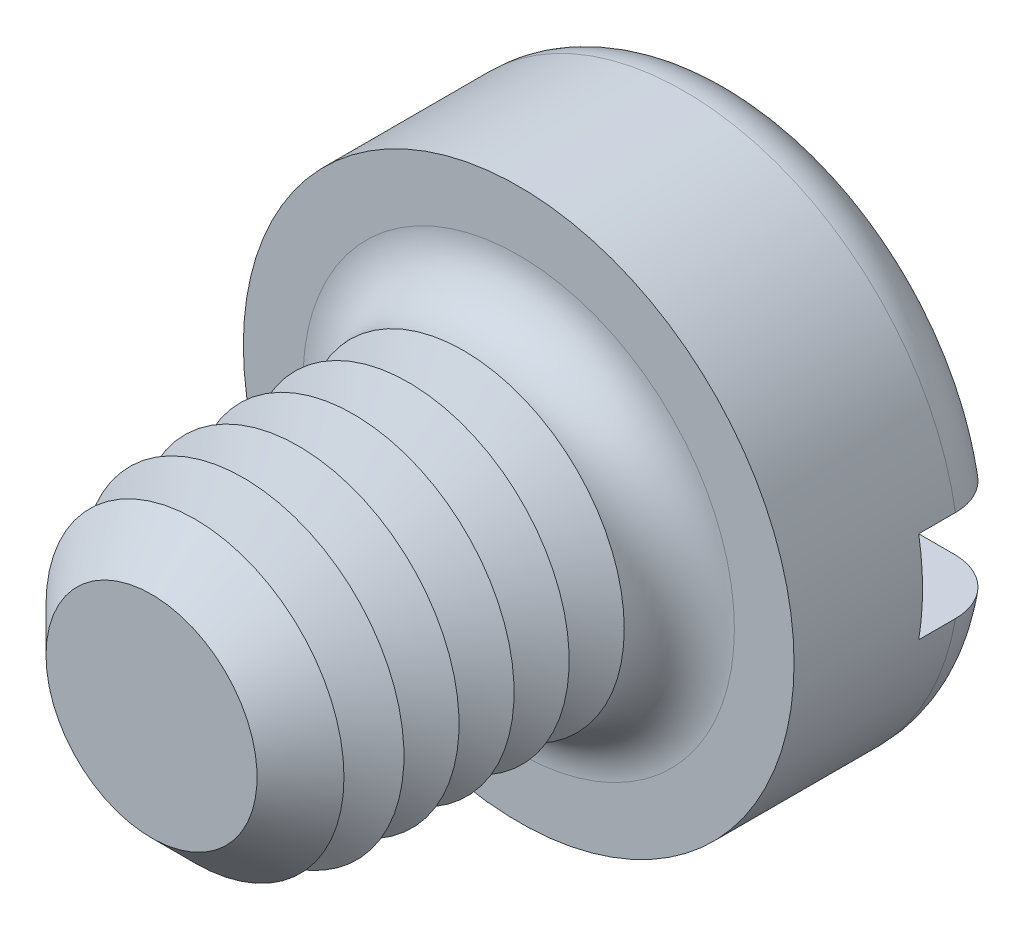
ISO-10303-21;
HEADER;
FILE_DESCRIPTION(('STEP AP214'),'2;1');
FILE_NAME('part.step','',(''),(''),'','','');
FILE_SCHEMA(('AUTOMOTIVE_DESIGN { 1 0 10303 214 1 1 1 1 }'));
ENDSEC;
DATA;
#1=APPLICATION_CONTEXT('core data for automotive mechanical design processes');
#2=APPLICATION_PROTOCOL_DEFINITION('international standard','automotive_design',2000,#1);
#3=PRODUCT_CONTEXT('',#1,'mechanical');
#4=PRODUCT('Part','Part','',(#3));
#5=PRODUCT_RELATED_PRODUCT_CATEGORY('part','',(#4));
#6=PRODUCT_DEFINITION_FORMATION('','',#4);
#7=PRODUCT_DEFINITION_CONTEXT('part definition',#1,'design');
#8=PRODUCT_DEFINITION('design','',#6,#7);
#9=PRODUCT_DEFINITION_SHAPE('','',#8);
#10=(LENGTH_UNIT() NAMED_UNIT(*) SI_UNIT(.MILLI.,.METRE.));
#11=(NAMED_UNIT(*) PLANE_ANGLE_UNIT() SI_UNIT($,.RADIAN.));
#12=(NAMED_UNIT(*) SI_UNIT($,.STERADIAN.) SOLID_ANGLE_UNIT());
#13=UNCERTAINTY_MEASURE_WITH_UNIT(LENGTH_MEASURE(1.E-05),#10,'distance_accuracy_value','');
#14=(GEOMETRIC_REPRESENTATION_CONTEXT(3) GLOBAL_UNCERTAINTY_ASSIGNED_CONTEXT((#13)) GLOBAL_UNIT_ASSIGNED_CONTEXT((#10,
#11,#12)) REPRESENTATION_CONTEXT('',''));
#15=CARTESIAN_POINT('',(0.,0.,0.));
#16=DIRECTION('',(0.,0.,1.));
#17=DIRECTION('',(1.,0.,0.));
#18=AXIS2_PLACEMENT_3D('',#15,#16,#17);
#19=CARTESIAN_POINT('',(0.,0.,-2.4));
#20=DIRECTION('',(0.,0.,1.));
#21=DIRECTION('',(1.,0.,0.));
#22=AXIS2_PLACEMENT_3D('',#19,#20,#21);
#23=PLANE('',#22);
#24=CARTESIAN_POINT('',(0.,0.,-2.4));
#25=DIRECTION('',(0.,0.,1.));
#26=DIRECTION('',(1.,0.,0.));
#27=AXIS2_PLACEMENT_3D('',#24,#25,#26);
#28=CIRCLE('',#27,2.4);
#29=CARTESIAN_POINT('',(-2.3473389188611,0.5,-2.4));
#30=VERTEX_POINT('',#29);
#31=CARTESIAN_POINT('',(2.3473389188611,0.5,-2.4));
#32=VERTEX_POINT('',#31);
#33=EDGE_CURVE('E116',#30,#32,#28,.F.);
#34=ORIENTED_EDGE('',*,*,#33,.T.);
#35=DIRECTION('',(1.,0.,0.));
#36=VECTOR('',#35,1.);
#37=CARTESIAN_POINT('',(-3.,0.5,-2.4));
#38=LINE('',#37,#36);
#39=EDGE_CURVE('E111',#30,#32,#38,.T.);
#40=ORIENTED_EDGE('',*,*,#39,.F.);
#41=EDGE_LOOP('',(#34,#40));
#42=FACE_BOUND('',#41,.T.);
#43=ADVANCED_FACE('F39',(#42),#23,.F.);
#44=CARTESIAN_POINT('',(0.,0.,-1.8));
#45=DIRECTION('',(0.,0.,1.));
#46=DIRECTION('',(1.,0.,0.));
#47=AXIS2_PLACEMENT_3D('',#44,#45,#46);
#48=TOROIDAL_SURFACE('',#47,2.4,0.6);
#49=CARTESIAN_POINT('',(-2.85761641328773,0.5,-2.13010535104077));
#50=CARTESIAN_POINT('',(-2.83871556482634,0.5,-2.1583605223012));
#51=CARTESIAN_POINT('',(-2.81738546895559,0.5,-2.18502342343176));
#52=CARTESIAN_POINT('',(-2.7705148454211,0.5,-2.23439244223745));
#53=CARTESIAN_POINT('',(-2.74496859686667,0.5,-2.25709309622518));
#54=CARTESIAN_POINT('',(-2.6904684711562,0.5,-2.29787524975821));
#55=CARTESIAN_POINT('',(-2.66151863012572,0.5,-2.3159621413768));
#56=CARTESIAN_POINT('',(-2.60103287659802,0.5,-2.34708203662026));
#57=CARTESIAN_POINT('',(-2.56949759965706,0.5,-2.36011627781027));
#58=CARTESIAN_POINT('',(-2.50430694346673,0.5,-2.38095952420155));
#59=CARTESIAN_POINT('',(-2.47062984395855,0.5,-2.38870056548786));
#60=CARTESIAN_POINT('',(-2.40245905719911,0.5,-2.39852415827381));
#61=CARTESIAN_POINT('',(-2.36796525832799,0.5,-2.40060593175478));
#62=CARTESIAN_POINT('',(-2.29850850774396,0.5,-2.39907718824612));
#63=CARTESIAN_POINT('',(-2.2635477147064,0.5,-2.3953679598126));
#64=CARTESIAN_POINT('',(-2.19472542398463,0.5,-2.38219781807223));
#65=CARTESIAN_POINT('',(-2.16086402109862,0.5,-2.37273641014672));
#66=CARTESIAN_POINT('',(-2.09483473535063,0.5,-2.3481926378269));
#67=CARTESIAN_POINT('',(-2.06268841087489,0.5,-2.3330521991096));
#68=CARTESIAN_POINT('',(-2.00140871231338,0.5,-2.29756210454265));
#69=CARTESIAN_POINT('',(-1.97227539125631,0.5,-2.27721235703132));
#70=CARTESIAN_POINT('',(-1.91805676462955,0.5,-2.23196210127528));
#71=CARTESIAN_POINT('',(-1.89294995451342,0.5,-2.20708739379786));
#72=CARTESIAN_POINT('',(-1.84740424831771,0.5,-2.1533758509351));
#73=CARTESIAN_POINT('',(-1.82696468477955,0.5,-2.1245395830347));
#74=CARTESIAN_POINT('',(-1.7919439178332,0.5,-2.06452274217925));
#75=CARTESIAN_POINT('',(-1.7772221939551,0.5,-2.03342424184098));
#76=CARTESIAN_POINT('',(-1.75343025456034,0.5,-1.96913621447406));
#77=CARTESIAN_POINT('',(-1.74435859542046,0.5,-1.93594722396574));
#78=CARTESIAN_POINT('',(-1.73243855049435,0.5,-1.86969199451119));
#79=CARTESIAN_POINT('',(-1.72938008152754,0.5,-1.83666346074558));
#80=CARTESIAN_POINT('',(-1.72896592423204,0.5,-1.77057287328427));
#81=CARTESIAN_POINT('',(-1.73160950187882,0.5,-1.73751082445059));
#82=CARTESIAN_POINT('',(-1.7423966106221,0.5,-1.6729183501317));
#83=CARTESIAN_POINT('',(-1.75043952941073,0.5,-1.64137102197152));
#84=CARTESIAN_POINT('',(-1.77163396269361,0.5,-1.58004446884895));
#85=CARTESIAN_POINT('',(-1.78478577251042,0.5,-1.55026534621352));
#86=CARTESIAN_POINT('',(-1.81598186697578,0.5,-1.49283859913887));
#87=CARTESIAN_POINT('',(-1.83409369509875,0.5,-1.46522772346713));
#88=CARTESIAN_POINT('',(-1.87455179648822,0.5,-1.41330756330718));
#89=CARTESIAN_POINT('',(-1.89689874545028,0.5,-1.38899880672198));
#90=CARTESIAN_POINT('',(-1.94600584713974,0.5,-1.34349499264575));
#91=CARTESIAN_POINT('',(-1.97289034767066,0.5,-1.32243411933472));
#92=CARTESIAN_POINT('',(-2.02972905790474,0.5,-1.28496935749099));
#93=CARTESIAN_POINT('',(-2.05968375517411,0.5,-1.26856621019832));
#94=CARTESIAN_POINT('',(-2.12276894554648,0.5,-1.24040709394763));
#95=CARTESIAN_POINT('',(-2.15596700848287,0.5,-1.22880230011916));
#96=CARTESIAN_POINT('',(-2.22383000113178,0.5,-1.21126311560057));
#97=CARTESIAN_POINT('',(-2.25849504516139,0.5,-1.20532916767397));
#98=CARTESIAN_POINT('',(-2.32870403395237,0.5,-1.1992792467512));
#99=CARTESIAN_POINT('',(-2.36425340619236,0.5,-1.19922586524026));
#100=CARTESIAN_POINT('',(-2.4348506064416,0.5,-1.2051326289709));
#101=CARTESIAN_POINT('',(-2.4698984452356,0.5,-1.21109264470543));
#102=CARTESIAN_POINT('',(-2.53821803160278,0.5,-1.22883658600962));
#103=CARTESIAN_POINT('',(-2.57150081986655,0.5,-1.24057794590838));
#104=CARTESIAN_POINT('',(-2.63557260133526,0.5,-1.2695744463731));
#105=CARTESIAN_POINT('',(-2.66636179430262,0.5,-1.28682914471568));
#106=CARTESIAN_POINT('',(-2.72402406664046,0.5,-1.32606063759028));
#107=CARTESIAN_POINT('',(-2.75095352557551,0.5,-1.34795455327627));
#108=CARTESIAN_POINT('',(-2.80067182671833,0.5,-1.39602603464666));
#109=CARTESIAN_POINT('',(-2.82346106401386,0.5,-1.42220319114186));
#110=CARTESIAN_POINT('',(-2.86383281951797,0.5,-1.47760238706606));
#111=CARTESIAN_POINT('',(-2.88149947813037,0.5,-1.50676312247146));
#112=CARTESIAN_POINT('',(-2.91160874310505,0.5,-1.56766595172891));
#113=CARTESIAN_POINT('',(-2.92405198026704,0.5,-1.59940773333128));
#114=CARTESIAN_POINT('',(-2.94319943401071,0.5,-1.66411282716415));
#115=CARTESIAN_POINT('',(-2.94997843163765,0.5,-1.69705402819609));
#116=CARTESIAN_POINT('',(-2.95787009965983,0.5,-1.7636173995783));
#117=CARTESIAN_POINT('',(-2.95898157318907,0.5,-1.79723971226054));
#118=CARTESIAN_POINT('',(-2.95551354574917,0.5,-1.86397776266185));
#119=CARTESIAN_POINT('',(-2.95096897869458,0.5,-1.89709534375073));
#120=CARTESIAN_POINT('',(-2.93638731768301,0.5,-1.96206785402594));
#121=CARTESIAN_POINT('',(-2.92635713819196,0.5,-1.99392431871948));
#122=CARTESIAN_POINT('',(-2.90618743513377,0.5,-2.04315073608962));
#123=CARTESIAN_POINT('',(-2.89769874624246,0.5,-2.06121519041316));
#124=CARTESIAN_POINT('',(-2.87895753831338,0.5,-2.096404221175));
#125=CARTESIAN_POINT('',(-2.86870503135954,0.5,-2.11352880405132));
#126=CARTESIAN_POINT('',(-2.85761641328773,0.5,-2.13010535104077));
#127=B_SPLINE_CURVE_WITH_KNOTS('',3,(#49,#50,#51,#52,#53,#54,#55,#56,#57,#58,#59,#60,#61,#62,
#63,#64,#65,#66,#67,#68,#69,#70,#71,#72,#73,#74,#75,#76,#77,#78,#79,#80,#81,#82,#83,#84,#85,#86,
#87,#88,#89,#90,#91,#92,#93,#94,#95,#96,#97,#98,#99,#100,#101,#102,#103,#104,#105,#106,#107,
#108,#109,#110,#111,#112,#113,#114,#115,#116,#117,#118,#119,#120,#121,#122,#123,#124,#125,#126),
.UNSPECIFIED.,.T.,.F.,(4,2,2,2,2,2,2,2,2,2,2,2,2,2,2,2,2,2,2,2,2,2,2,2,2,2,2,2,2,2,2,2,2,2,2,2,
2,2,4),(0.,0.101907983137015,0.203955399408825,0.305883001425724,0.40778562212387,
0.51097325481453,0.61417507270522,0.719155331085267,0.824144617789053,0.930238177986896,
1.03633360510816,1.14184204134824,1.24733537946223,1.35004136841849,1.45272110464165,
1.5517448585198,1.65075586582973,1.74797128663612,1.84519232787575,1.9438094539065,
2.0424423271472,2.14443321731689,2.24644032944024,2.35145317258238,2.45647421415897,
2.56261297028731,2.66874944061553,2.77411589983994,2.87947390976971,2.98308820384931,
3.08669260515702,3.18848388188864,3.29026286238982,3.39067588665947,3.49111011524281,
3.59092708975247,3.69061853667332,3.75040561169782,3.81019227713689),.UNSPECIFIED.);
#128=CARTESIAN_POINT('',(-2.95803989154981,0.5,-1.8));
#129=VERTEX_POINT('',#128);
#130=EDGE_CURVE('E225',#129,#30,#127,.T.);
#131=ORIENTED_EDGE('',*,*,#130,.F.);
#132=CARTESIAN_POINT('',(0.,0.,-1.8));
#133=DIRECTION('',(0.,0.,1.));
#134=DIRECTION('',(1.,0.,0.));
#135=AXIS2_PLACEMENT_3D('',#132,#133,#134);
#136=CIRCLE('',#135,3.);
#137=CARTESIAN_POINT('',(2.95803989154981,0.5,-1.8));
#138=VERTEX_POINT('',#137);
#139=EDGE_CURVE('E125',#138,#129,#136,.T.);
#140=ORIENTED_EDGE('',*,*,#139,.F.);
#141=CARTESIAN_POINT('',(1.78664846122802,0.5,-2.05158390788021));
#142=CARTESIAN_POINT('',(1.80142751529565,0.5,-2.08239430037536));
#143=CARTESIAN_POINT('',(1.81889355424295,0.5,-2.11194905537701));
#144=CARTESIAN_POINT('',(1.8585933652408,0.5,-2.16770384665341));
#145=CARTESIAN_POINT('',(1.88083491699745,0.5,-2.19389829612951));
#146=CARTESIAN_POINT('',(1.92931942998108,0.5,-2.24217519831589));
#147=CARTESIAN_POINT('',(1.95555471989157,0.5,-2.26426535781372));
#148=CARTESIAN_POINT('',(2.01127789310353,0.5,-2.30384045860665));
#149=CARTESIAN_POINT('',(2.04076488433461,0.5,-2.32132665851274));
#150=CARTESIAN_POINT('',(2.10290022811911,0.5,-2.3516259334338));
#151=CARTESIAN_POINT('',(2.13560600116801,0.5,-2.3643213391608));
#152=CARTESIAN_POINT('',(2.20267136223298,0.5,-2.38412242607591));
#153=CARTESIAN_POINT('',(2.23703118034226,0.5,-2.3912273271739));
#154=CARTESIAN_POINT('',(2.30690186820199,0.5,-2.39969404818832));
#155=CARTESIAN_POINT('',(2.34242185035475,0.5,-2.40098100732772));
#156=CARTESIAN_POINT('',(2.41317063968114,0.5,-2.39753827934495));
#157=CARTESIAN_POINT('',(2.44839945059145,0.5,-2.39280866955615));
#158=CARTESIAN_POINT('',(2.51734146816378,0.5,-2.37746773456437));
#159=CARTESIAN_POINT('',(2.55106223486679,0.5,-2.3668904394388));
#160=CARTESIAN_POINT('',(2.61620389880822,0.5,-2.34013333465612));
#161=CARTESIAN_POINT('',(2.64762498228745,0.5,-2.32395397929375));
#162=CARTESIAN_POINT('',(2.70673284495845,0.5,-2.28672393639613));
#163=CARTESIAN_POINT('',(2.73447138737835,0.5,-2.26575544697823));
#164=CARTESIAN_POINT('',(2.78595339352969,0.5,-2.21938197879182));
#165=CARTESIAN_POINT('',(2.80969724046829,0.5,-2.19397742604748));
#166=CARTESIAN_POINT('',(2.85207235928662,0.5,-2.13993965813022));
#167=CARTESIAN_POINT('',(2.87078674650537,0.5,-2.11137160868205));
#168=CARTESIAN_POINT('',(2.90307455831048,0.5,-2.05146448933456));
#169=CARTESIAN_POINT('',(2.91664841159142,0.5,-2.02012565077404));
#170=CARTESIAN_POINT('',(2.93808283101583,0.5,-1.95603682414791));
#171=CARTESIAN_POINT('',(2.94602016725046,0.5,-1.92331249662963));
#172=CARTESIAN_POINT('',(2.95624273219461,0.5,-1.85699296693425));
#173=CARTESIAN_POINT('',(2.95852824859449,0.5,-1.82339780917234));
#174=CARTESIAN_POINT('',(2.95738171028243,0.5,-1.75655451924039));
#175=CARTESIAN_POINT('',(2.95399174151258,0.5,-1.72330565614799));
#176=CARTESIAN_POINT('',(2.94167749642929,0.5,-1.65784996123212));
#177=CARTESIAN_POINT('',(2.93275329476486,0.5,-1.62564311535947));
#178=CARTESIAN_POINT('',(2.90963870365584,0.5,-1.56317641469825));
#179=CARTESIAN_POINT('',(2.89544787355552,0.5,-1.53291672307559));
#180=CARTESIAN_POINT('',(2.86222325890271,0.5,-1.47518589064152));
#181=CARTESIAN_POINT('',(2.84318935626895,0.5,-1.44771481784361));
#182=CARTESIAN_POINT('',(2.80067851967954,0.5,-1.39611362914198));
#183=CARTESIAN_POINT('',(2.77716960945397,0.5,-1.37200986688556));
#184=CARTESIAN_POINT('',(2.72648704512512,0.5,-1.3280274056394));
#185=CARTESIAN_POINT('',(2.69931317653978,0.5,-1.3081489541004));
#186=CARTESIAN_POINT('',(2.64167967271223,0.5,-1.27288334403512));
#187=CARTESIAN_POINT('',(2.61118015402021,0.5,-1.25756138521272));
#188=CARTESIAN_POINT('',(2.54807315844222,0.5,-1.2321564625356));
#189=CARTESIAN_POINT('',(2.51546550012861,0.5,-1.22207395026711));
#190=CARTESIAN_POINT('',(2.44846246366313,0.5,-1.20724783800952));
#191=CARTESIAN_POINT('',(2.41404584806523,0.5,-1.2026002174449));
#192=CARTESIAN_POINT('',(2.34491756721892,0.5,-1.19904907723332));
#193=CARTESIAN_POINT('',(2.3102058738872,0.5,-1.20014611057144));
#194=CARTESIAN_POINT('',(2.24087507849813,0.5,-1.20808958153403));
#195=CARTESIAN_POINT('',(2.20626660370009,0.5,-1.21502895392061));
#196=CARTESIAN_POINT('',(2.13868705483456,0.5,-1.23457616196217));
#197=CARTESIAN_POINT('',(2.10571611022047,0.5,-1.24718444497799));
#198=CARTESIAN_POINT('',(2.04212010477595,0.5,-1.2778419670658));
#199=CARTESIAN_POINT('',(2.0115131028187,0.5,-1.29592871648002));
#200=CARTESIAN_POINT('',(1.95381117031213,0.5,-1.33703838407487));
#201=CARTESIAN_POINT('',(1.92671618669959,0.5,-1.36006122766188));
#202=CARTESIAN_POINT('',(1.8771749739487,0.5,-1.41014760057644));
#203=CARTESIAN_POINT('',(1.85467966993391,0.5,-1.43716252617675));
#204=CARTESIAN_POINT('',(1.8147167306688,0.5,-1.49468601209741));
#205=CARTESIAN_POINT('',(1.79724791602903,0.5,-1.52519375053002));
#206=CARTESIAN_POINT('',(1.76843420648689,0.5,-1.58782676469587));
#207=CARTESIAN_POINT('',(1.75691546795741,0.5,-1.61987202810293));
#208=CARTESIAN_POINT('',(1.73963101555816,0.5,-1.68548715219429));
#209=CARTESIAN_POINT('',(1.73386545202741,0.5,-1.71905705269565));
#210=CARTESIAN_POINT('',(1.72840927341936,0.5,-1.78556262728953));
#211=CARTESIAN_POINT('',(1.72852416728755,0.5,-1.81848259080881));
#212=CARTESIAN_POINT('',(1.73434422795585,0.5,-1.88379362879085));
#213=CARTESIAN_POINT('',(1.74004181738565,0.5,-1.91618535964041));
#214=CARTESIAN_POINT('',(1.75312909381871,0.5,-1.96568884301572));
#215=CARTESIAN_POINT('',(1.75869685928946,0.5,-1.98330302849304));
#216=CARTESIAN_POINT('',(1.77146455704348,0.5,-2.01792824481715));
#217=CARTESIAN_POINT('',(1.7786644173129,0.5,-2.03493930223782));
#218=CARTESIAN_POINT('',(1.78664846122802,0.5,-2.05158390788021));
#219=B_SPLINE_CURVE_WITH_KNOTS('',3,(#141,#142,#143,#144,#145,#146,#147,#148,#149,#150,#151,
#152,#153,#154,#155,#156,#157,#158,#159,#160,#161,#162,#163,#164,#165,#166,#167,#168,#169,#170,
#171,#172,#173,#174,#175,#176,#177,#178,#179,#180,#181,#182,#183,#184,#185,#186,#187,#188,#189,
#190,#191,#192,#193,#194,#195,#196,#197,#198,#199,#200,#201,#202,#203,#204,#205,#206,#207,#208,
#209,#210,#211,#212,#213,#214,#215,#216,#217,#218),.UNSPECIFIED.,.T.,.F.,(4,2,2,2,2,2,2,2,2,2,2,
2,2,2,2,2,2,2,2,2,2,2,2,2,2,2,2,2,2,2,2,2,2,2,2,2,2,2,4),(0.,0.102444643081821,
0.205057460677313,0.307475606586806,0.409865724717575,0.514628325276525,0.619405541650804,
0.725527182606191,0.831647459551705,0.937156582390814,1.04265715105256,1.14646746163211,
1.25026780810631,1.3522293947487,1.45418247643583,1.55471883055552,1.6552500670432,
1.75503912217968,1.8548268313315,1.95462289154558,2.05442138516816,2.15496174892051,
2.25550799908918,2.35743049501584,2.45936177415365,2.56306719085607,2.66678259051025,
2.77217967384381,2.87758507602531,2.98372914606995,3.08987161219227,3.19481457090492,
3.29973288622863,3.40138228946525,3.50303434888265,3.6013265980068,3.69948562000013,
3.75483142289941,3.8101747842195),.UNSPECIFIED.);
#220=EDGE_CURVE('E227',#32,#138,#219,.T.);
#221=ORIENTED_EDGE('',*,*,#220,.F.);
#222=ORIENTED_EDGE('',*,*,#33,.F.);
#223=EDGE_LOOP('',(#131,#140,#221,#222));
#224=FACE_BOUND('',#223,.T.);
#225=ADVANCED_FACE('F209',(#224),#48,.T.);
#226=CARTESIAN_POINT('',(0.,0.,-2.4));
#227=DIRECTION('',(0.,0.,1.));
#228=DIRECTION('',(1.,0.,0.));
#229=AXIS2_PLACEMENT_3D('',#226,#227,#228);
#230=CYLINDRICAL_SURFACE('',#229,3.);
#231=DIRECTION('',(0.,0.,1.));
#232=VECTOR('',#231,1.);
#233=CARTESIAN_POINT('',(2.95803989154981,0.5,-2.4));
#234=LINE('',#233,#232);
#235=CARTESIAN_POINT('',(2.95803989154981,0.5,-1.4));
#236=VERTEX_POINT('',#235);
#237=EDGE_CURVE('E242',#138,#236,#234,.T.);
#238=ORIENTED_EDGE('',*,*,#237,.F.);
#239=ORIENTED_EDGE('',*,*,#139,.T.);
#240=DIRECTION('',(0.,0.,1.));
#241=VECTOR('',#240,1.);
#242=CARTESIAN_POINT('',(-2.95803989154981,0.5,-2.4));
#243=LINE('',#242,#241);
#244=CARTESIAN_POINT('',(-2.95803989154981,0.5,-1.4));
#245=VERTEX_POINT('',#244);
#246=EDGE_CURVE('E63',#245,#129,#243,.F.);
#247=ORIENTED_EDGE('',*,*,#246,.F.);
#248=CARTESIAN_POINT('',(0.,0.,-1.4));
#249=DIRECTION('',(0.,0.,-1.));
#250=DIRECTION('',(-1.,0.,0.));
#251=AXIS2_PLACEMENT_3D('',#248,#249,#250);
#252=CIRCLE('',#251,3.);
#253=CARTESIAN_POINT('',(-2.95803989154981,-0.5,-1.4));
#254=VERTEX_POINT('',#253);
#255=EDGE_CURVE('E43',#245,#254,#252,.F.);
#256=ORIENTED_EDGE('',*,*,#255,.T.);
#257=DIRECTION('',(0.,0.,1.));
#258=VECTOR('',#257,1.);
#259=CARTESIAN_POINT('',(-2.95803989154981,-0.5,-2.4));
#260=LINE('',#259,#258);
#261=CARTESIAN_POINT('',(-2.9580398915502,-0.5,-1.79999999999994));
#262=VERTEX_POINT('',#261);
#263=EDGE_CURVE('E239',#262,#254,#260,.T.);
#264=ORIENTED_EDGE('',*,*,#263,.F.);
#265=CARTESIAN_POINT('',(2.95803989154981,-0.5,-1.8));
#266=VERTEX_POINT('',#265);
#267=EDGE_CURVE('E127',#262,#266,#136,.T.);
#268=ORIENTED_EDGE('',*,*,#267,.T.);
#269=DIRECTION('',(0.,0.,1.));
#270=VECTOR('',#269,1.);
#271=CARTESIAN_POINT('',(2.95803989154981,-0.5,-2.4));
#272=LINE('',#271,#270);
#273=CARTESIAN_POINT('',(2.95803989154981,-0.5,-1.4));
#274=VERTEX_POINT('',#273);
#275=EDGE_CURVE('E55',#274,#266,#272,.F.);
#276=ORIENTED_EDGE('',*,*,#275,.F.);
#277=EDGE_CURVE('E11',#274,#236,#252,.F.);
#278=ORIENTED_EDGE('',*,*,#277,.T.);
#279=EDGE_LOOP('',(#238,#239,#247,#256,#264,#268,#276,#278));
#280=FACE_BOUND('',#279,.T.);
#281=CARTESIAN_POINT('',(0.,0.,0.));
#282=DIRECTION('',(0.,0.,1.));
#283=DIRECTION('',(1.,0.,0.));
#284=AXIS2_PLACEMENT_3D('',#281,#282,#283);
#285=CIRCLE('',#284,3.);
#286=CARTESIAN_POINT('',(3.,0.,0.));
#287=VERTEX_POINT('',#286);
#288=EDGE_CURVE('E245',#287,#287,#285,.T.);
#289=ORIENTED_EDGE('',*,*,#288,.F.);
#290=EDGE_LOOP('',(#289));
#291=FACE_BOUND('',#290,.T.);
#292=ADVANCED_FACE('F205',(#280,#291),#230,.T.);
#293=CARTESIAN_POINT('',(2.3473389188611,-0.5,-2.4));
#294=VERTEX_POINT('',#293);
#295=CARTESIAN_POINT('',(-2.3473389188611,-0.5,-2.4));
#296=VERTEX_POINT('',#295);
#297=EDGE_CURVE('E109',#294,#296,#28,.F.);
#298=ORIENTED_EDGE('',*,*,#297,.T.);
#299=DIRECTION('',(-1.,0.,0.));
#300=VECTOR('',#299,1.);
#301=CARTESIAN_POINT('',(-3.,-0.5,-2.4));
#302=LINE('',#301,#300);
#303=EDGE_CURVE('E96',#294,#296,#302,.T.);
#304=ORIENTED_EDGE('',*,*,#303,.F.);
#305=EDGE_LOOP('',(#298,#304));
#306=FACE_BOUND('',#305,.T.);
#307=ADVANCED_FACE('F108',(#306),#23,.F.);
#308=CARTESIAN_POINT('',(0.,0.,0.));
#309=DIRECTION('',(0.,0.,1.));
#310=DIRECTION('',(1.,0.,0.));
#311=AXIS2_PLACEMENT_3D('',#308,#309,#310);
#312=PLANE('',#311);
#313=CARTESIAN_POINT('',(0.,0.,0.));
#314=DIRECTION('',(0.,0.,1.));
#315=DIRECTION('',(1.,0.,0.));
#316=AXIS2_PLACEMENT_3D('',#313,#314,#315);
#317=CIRCLE('',#316,2.35);
#318=CARTESIAN_POINT('',(2.35,0.,0.));
#319=VERTEX_POINT('',#318);
#320=EDGE_CURVE('E115',#319,#319,#317,.F.);
#321=ORIENTED_EDGE('',*,*,#320,.T.);
#322=EDGE_LOOP('',(#321));
#323=FACE_BOUND('',#322,.T.);
#324=ORIENTED_EDGE('',*,*,#288,.T.);
#325=EDGE_LOOP('',(#324));
#326=FACE_BOUND('',#325,.T.);
#327=ADVANCED_FACE('F204',(#323,#326),#312,.T.);
#328=CARTESIAN_POINT('',(-2.85761641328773,-0.5,-2.13010535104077));
#329=CARTESIAN_POINT('',(-2.87617085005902,-0.5,-2.10236255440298));
#330=CARTESIAN_POINT('',(-2.89241094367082,-0.5,-2.07304478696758));
#331=CARTESIAN_POINT('',(-2.91975805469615,-0.5,-2.01207835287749));
#332=CARTESIAN_POINT('',(-2.93085958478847,-0.5,-1.98042723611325));
#333=CARTESIAN_POINT('',(-2.94757590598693,-0.5,-1.91570997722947));
#334=CARTESIAN_POINT('',(-2.95319165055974,-0.5,-1.88264408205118));
#335=CARTESIAN_POINT('',(-2.95876526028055,-0.5,-1.81604673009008));
#336=CARTESIAN_POINT('',(-2.95872441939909,-0.5,-1.78251538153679));
#337=CARTESIAN_POINT('',(-2.95300126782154,-0.5,-1.71606888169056));
#338=CARTESIAN_POINT('',(-2.94734076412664,-0.5,-1.68315184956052));
#339=CARTESIAN_POINT('',(-2.93058183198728,-0.5,-1.61873244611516));
#340=CARTESIAN_POINT('',(-2.91948325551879,-0.5,-1.58723011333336));
#341=CARTESIAN_POINT('',(-2.89215903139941,-0.5,-1.52647404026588));
#342=CARTESIAN_POINT('',(-2.87592518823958,-0.5,-1.49722398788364));
#343=CARTESIAN_POINT('',(-2.83881787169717,-0.5,-1.44183365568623));
#344=CARTESIAN_POINT('',(-2.8179442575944,-0.5,-1.41569347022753));
#345=CARTESIAN_POINT('',(-2.77196258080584,-0.5,-1.36700890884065));
#346=CARTESIAN_POINT('',(-2.74681874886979,-0.5,-1.34449832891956));
#347=CARTESIAN_POINT('',(-2.69315595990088,-0.5,-1.30394571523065));
#348=CARTESIAN_POINT('',(-2.66463678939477,-0.5,-1.28590396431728));
#349=CARTESIAN_POINT('',(-2.6045885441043,-0.5,-1.25451133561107));
#350=CARTESIAN_POINT('',(-2.573021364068,-0.5,-1.24123336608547));
#351=CARTESIAN_POINT('',(-2.50813094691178,-0.5,-1.22006271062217));
#352=CARTESIAN_POINT('',(-2.47480755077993,-0.5,-1.21217051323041));
#353=CARTESIAN_POINT('',(-2.40672281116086,-0.5,-1.20185046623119));
#354=CARTESIAN_POINT('',(-2.37194646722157,-0.5,-1.19952155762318));
#355=CARTESIAN_POINT('',(-2.30248663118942,-0.5,-1.20064178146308));
#356=CARTESIAN_POINT('',(-2.26780314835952,-0.5,-1.20409147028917));
#357=CARTESIAN_POINT('',(-2.19896003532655,-0.5,-1.21674803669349));
#358=CARTESIAN_POINT('',(-2.16481620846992,-0.5,-1.22604100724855));
#359=CARTESIAN_POINT('',(-2.09855902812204,-0.5,-1.25020237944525));
#360=CARTESIAN_POINT('',(-2.0664458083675,-0.5,-1.2650711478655));
#361=CARTESIAN_POINT('',(-2.00504979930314,-0.5,-1.3000633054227));
#362=CARTESIAN_POINT('',(-1.97577870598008,-0.5,-1.32020724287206));
#363=CARTESIAN_POINT('',(-1.92109882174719,-0.5,-1.36519538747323));
#364=CARTESIAN_POINT('',(-1.89568984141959,-0.5,-1.39003936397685));
#365=CARTESIAN_POINT('',(-1.84992350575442,-0.5,-1.44333696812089));
#366=CARTESIAN_POINT('',(-1.82949305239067,-0.5,-1.47172774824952));
#367=CARTESIAN_POINT('',(-1.79388305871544,-0.5,-1.53163225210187));
#368=CARTESIAN_POINT('',(-1.77870235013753,-0.5,-1.56314527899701));
#369=CARTESIAN_POINT('',(-1.7545759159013,-0.5,-1.62726698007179));
#370=CARTESIAN_POINT('',(-1.74543784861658,-0.5,-1.65980327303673));
#371=CARTESIAN_POINT('',(-1.73294830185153,-0.5,-1.72596654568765));
#372=CARTESIAN_POINT('',(-1.72959555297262,-0.5,-1.7595932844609));
#373=CARTESIAN_POINT('',(-1.72881879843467,-0.5,-1.82588200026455));
#374=CARTESIAN_POINT('',(-1.73121660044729,-0.5,-1.85854202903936));
#375=CARTESIAN_POINT('',(-1.74148022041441,-0.5,-1.9229888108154));
#376=CARTESIAN_POINT('',(-1.74934586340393,-0.5,-1.95477559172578));
#377=CARTESIAN_POINT('',(-1.77023164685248,-0.5,-2.01650910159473));
#378=CARTESIAN_POINT('',(-1.78323812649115,-0.5,-2.04646046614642));
#379=CARTESIAN_POINT('',(-1.81396733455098,-0.5,-2.10383471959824));
#380=CARTESIAN_POINT('',(-1.83169061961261,-0.5,-2.13125730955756));
#381=CARTESIAN_POINT('',(-1.87183626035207,-0.5,-2.18359240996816));
#382=CARTESIAN_POINT('',(-1.89437158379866,-0.5,-2.20841820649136));
#383=CARTESIAN_POINT('',(-1.94316463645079,-0.5,-2.25409214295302));
#384=CARTESIAN_POINT('',(-1.96942301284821,-0.5,-2.27493958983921));
#385=CARTESIAN_POINT('',(-2.025898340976,-0.5,-2.31281042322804));
#386=CARTESIAN_POINT('',(-2.0562208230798,-0.5,-2.32967654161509));
#387=CARTESIAN_POINT('',(-2.11922391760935,-0.5,-2.35820255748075));
#388=CARTESIAN_POINT('',(-2.15190483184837,-0.5,-2.3698617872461));
#389=CARTESIAN_POINT('',(-2.21944675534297,-0.5,-2.38785911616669));
#390=CARTESIAN_POINT('',(-2.25433929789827,-0.5,-2.39407914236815));
#391=CARTESIAN_POINT('',(-2.32467357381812,-0.5,-2.40058243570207));
#392=CARTESIAN_POINT('',(-2.36011530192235,-0.5,-2.40086575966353));
#393=CARTESIAN_POINT('',(-2.43058129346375,-0.5,-2.39545061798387));
#394=CARTESIAN_POINT('',(-2.46560504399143,-0.5,-2.38974544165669));
#395=CARTESIAN_POINT('',(-2.53418188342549,-0.5,-2.37245602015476));
#396=CARTESIAN_POINT('',(-2.56773468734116,-0.5,-2.36087064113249));
#397=CARTESIAN_POINT('',(-2.63195003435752,-0.5,-2.33229154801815));
#398=CARTESIAN_POINT('',(-2.66264330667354,-0.5,-2.31536681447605));
#399=CARTESIAN_POINT('',(-2.72065333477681,-0.5,-2.2765252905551));
#400=CARTESIAN_POINT('',(-2.7479744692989,-0.5,-2.25461508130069));
#401=CARTESIAN_POINT('',(-2.78903570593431,-0.5,-2.21539504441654));
#402=CARTESIAN_POINT('',(-2.80405150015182,-0.5,-2.19939833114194));
#403=CARTESIAN_POINT('',(-2.83224965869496,-0.5,-2.16586257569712));
#404=CARTESIAN_POINT('',(-2.84543204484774,-0.5,-2.14832355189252));
#405=CARTESIAN_POINT('',(-2.85761641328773,-0.5,-2.13010535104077));
#406=B_SPLINE_CURVE_WITH_KNOTS('',3,(#328,#329,#330,#331,#332,#333,#334,#335,#336,#337,#338,
#339,#340,#341,#342,#343,#344,#345,#346,#347,#348,#349,#350,#351,#352,#353,#354,#355,#356,#357,
#358,#359,#360,#361,#362,#363,#364,#365,#366,#367,#368,#369,#370,#371,#372,#373,#374,#375,#376,
#377,#378,#379,#380,#381,#382,#383,#384,#385,#386,#387,#388,#389,#390,#391,#392,#393,#394,#395,
#396,#397,#398,#399,#400,#401,#402,#403,#404,#405),.UNSPECIFIED.,.T.,.F.,(4,2,2,2,2,2,2,2,2,2,2,
2,2,2,2,2,2,2,2,2,2,2,2,2,2,2,2,2,2,2,2,2,2,2,2,2,2,2,4),(0.,0.100047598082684,
0.200201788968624,0.300338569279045,0.400452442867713,0.500179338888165,0.599908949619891,
0.699798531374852,0.799691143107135,0.900465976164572,1.00124718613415,1.10351091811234,
1.20578392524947,1.30986270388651,1.41395150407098,1.51961105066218,1.62527754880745,
1.73136193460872,1.83744111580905,1.94185359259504,2.04624281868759,2.1471248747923,
2.24798479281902,2.34575994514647,2.44353196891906,2.54104590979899,2.63857136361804,
2.73870431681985,2.83885469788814,2.94247024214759,3.0460990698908,3.15192527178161,
3.25775046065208,3.36369436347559,3.46965870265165,3.57430655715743,3.67881706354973,
3.74451732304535,3.81021680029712),.UNSPECIFIED.);
#407=EDGE_CURVE('E103',#296,#262,#406,.T.);
#408=ORIENTED_EDGE('',*,*,#407,.F.);
#409=ORIENTED_EDGE('',*,*,#297,.F.);
#410=CARTESIAN_POINT('',(1.78664846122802,-0.5,-2.05158390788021));
#411=CARTESIAN_POINT('',(1.77253256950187,-0.5,-2.02214917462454));
#412=CARTESIAN_POINT('',(1.76084795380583,-0.5,-1.99152692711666));
#413=CARTESIAN_POINT('',(1.74276267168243,-0.5,-1.92873811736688));
#414=CARTESIAN_POINT('',(1.73636622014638,-0.5,-1.89657034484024));
#415=CARTESIAN_POINT('',(1.72910271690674,-0.5,-1.83160458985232));
#416=CARTESIAN_POINT('',(1.72823699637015,-0.5,-1.79880645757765));
#417=CARTESIAN_POINT('',(1.73207277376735,-0.5,-1.73354460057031));
#418=CARTESIAN_POINT('',(1.7367732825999,-0.5,-1.70108081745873));
#419=CARTESIAN_POINT('',(1.75151033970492,-0.5,-1.63763571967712));
#420=CARTESIAN_POINT('',(1.76150868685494,-0.5,-1.60664550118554));
#421=CARTESIAN_POINT('',(1.78646773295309,-0.5,-1.54673433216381));
#422=CARTESIAN_POINT('',(1.80142897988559,-0.5,-1.51781361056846));
#423=CARTESIAN_POINT('',(1.8361687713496,-0.5,-1.46223275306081));
#424=CARTESIAN_POINT('',(1.85603637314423,-0.5,-1.43562834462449));
#425=CARTESIAN_POINT('',(1.89981598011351,-0.5,-1.38598822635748));
#426=CARTESIAN_POINT('',(1.92372865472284,-0.5,-1.3629531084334));
#427=CARTESIAN_POINT('',(1.97581791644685,-0.5,-1.32025912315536));
#428=CARTESIAN_POINT('',(2.00411431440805,-0.5,-1.30074638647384));
#429=CARTESIAN_POINT('',(2.06351340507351,-0.5,-1.26660223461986));
#430=CARTESIAN_POINT('',(2.09461651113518,-0.5,-1.2519715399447));
#431=CARTESIAN_POINT('',(2.15964055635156,-0.5,-1.22763649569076));
#432=CARTESIAN_POINT('',(2.19361437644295,-0.5,-1.21807321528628));
#433=CARTESIAN_POINT('',(2.26268197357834,-0.5,-1.20474094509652));
#434=CARTESIAN_POINT('',(2.29777581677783,-0.5,-1.20097229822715));
#435=CARTESIAN_POINT('',(2.36834397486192,-0.5,-1.19935270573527));
#436=CARTESIAN_POINT('',(2.40381924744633,-0.5,-1.20154258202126));
#437=CARTESIAN_POINT('',(2.47388621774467,-0.5,-1.211906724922));
#438=CARTESIAN_POINT('',(2.50847794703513,-0.5,-1.22008077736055));
#439=CARTESIAN_POINT('',(2.57542869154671,-0.5,-1.24211740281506));
#440=CARTESIAN_POINT('',(2.60780612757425,-0.5,-1.25592395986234));
#441=CARTESIAN_POINT('',(2.66972487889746,-0.5,-1.28886991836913));
#442=CARTESIAN_POINT('',(2.69926644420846,-0.5,-1.3080088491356));
#443=CARTESIAN_POINT('',(2.75412764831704,-0.5,-1.35072337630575));
#444=CARTESIAN_POINT('',(2.77951140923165,-0.5,-1.37421661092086));
#445=CARTESIAN_POINT('',(2.82588981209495,-0.5,-1.42519687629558));
#446=CARTESIAN_POINT('',(2.84688487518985,-0.5,-1.4526835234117));
#447=CARTESIAN_POINT('',(2.88351678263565,-0.5,-1.51036368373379));
#448=CARTESIAN_POINT('',(2.89923879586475,-0.5,-1.54050312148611));
#449=CARTESIAN_POINT('',(2.92532780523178,-0.5,-1.60301687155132));
#450=CARTESIAN_POINT('',(2.93569520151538,-0.5,-1.63539101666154));
#451=CARTESIAN_POINT('',(2.95066155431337,-0.5,-1.70102985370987));
#452=CARTESIAN_POINT('',(2.95532930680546,-0.5,-1.73427887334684));
#453=CARTESIAN_POINT('',(2.9589838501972,-0.5,-1.80108716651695));
#454=CARTESIAN_POINT('',(2.95797087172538,-0.5,-1.83464642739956));
#455=CARTESIAN_POINT('',(2.9503157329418,-0.5,-1.90093629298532));
#456=CARTESIAN_POINT('',(2.9437032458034,-0.5,-1.93367033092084));
#457=CARTESIAN_POINT('',(2.92508830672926,-0.5,-1.99756717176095));
#458=CARTESIAN_POINT('',(2.91308586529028,-0.5,-2.02872997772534));
#459=CARTESIAN_POINT('',(2.88401713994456,-0.5,-2.08868263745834));
#460=CARTESIAN_POINT('',(2.86693946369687,-0.5,-2.11746696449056));
#461=CARTESIAN_POINT('',(2.82823635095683,-0.5,-2.17179415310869));
#462=CARTESIAN_POINT('',(2.80661076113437,-0.5,-2.19733690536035));
#463=CARTESIAN_POINT('',(2.75921750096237,-0.5,-2.24472182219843));
#464=CARTESIAN_POINT('',(2.73341278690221,-0.5,-2.26652692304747));
#465=CARTESIAN_POINT('',(2.67855512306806,-0.5,-2.30557116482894));
#466=CARTESIAN_POINT('',(2.64950194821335,-0.5,-2.32280998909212));
#467=CARTESIAN_POINT('',(2.58850670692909,-0.5,-2.35251615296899));
#468=CARTESIAN_POINT('',(2.55652763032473,-0.5,-2.36490748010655));
#469=CARTESIAN_POINT('',(2.4909651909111,-0.5,-2.38424946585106));
#470=CARTESIAN_POINT('',(2.45738167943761,-0.5,-2.39119961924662));
#471=CARTESIAN_POINT('',(2.38892891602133,-0.5,-2.39958830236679));
#472=CARTESIAN_POINT('',(2.35404742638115,-0.5,-2.40092701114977));
#473=CARTESIAN_POINT('',(2.28454389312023,-0.5,-2.39781917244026));
#474=CARTESIAN_POINT('',(2.24992186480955,-0.5,-2.39337228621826));
#475=CARTESIAN_POINT('',(2.18139250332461,-0.5,-2.37872879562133));
#476=CARTESIAN_POINT('',(2.14750264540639,-0.5,-2.36845030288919));
#477=CARTESIAN_POINT('',(2.08190943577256,-0.5,-2.34236291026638));
#478=CARTESIAN_POINT('',(2.05020675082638,-0.5,-2.32655233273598));
#479=CARTESIAN_POINT('',(1.98982495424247,-0.5,-2.28976285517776));
#480=CARTESIAN_POINT('',(1.96115527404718,-0.5,-2.26876847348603));
#481=CARTESIAN_POINT('',(1.90785147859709,-0.5,-2.22220002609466));
#482=CARTESIAN_POINT('',(1.88321231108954,-0.5,-2.19663177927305));
#483=CARTESIAN_POINT('',(1.84638483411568,-0.5,-2.15106161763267));
#484=CARTESIAN_POINT('',(1.8328227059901,-0.5,-2.13215328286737));
#485=CARTESIAN_POINT('',(1.80797918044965,-0.5,-2.09289185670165));
#486=CARTESIAN_POINT('',(1.79669771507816,-0.5,-2.07253880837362));
#487=CARTESIAN_POINT('',(1.78664846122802,-0.5,-2.05158390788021));
#488=B_SPLINE_CURVE_WITH_KNOTS('',3,(#410,#411,#412,#413,#414,#415,#416,#417,#418,#419,#420,
#421,#422,#423,#424,#425,#426,#427,#428,#429,#430,#431,#432,#433,#434,#435,#436,#437,#438,#439,
#440,#441,#442,#443,#444,#445,#446,#447,#448,#449,#450,#451,#452,#453,#454,#455,#456,#457,#458,
#459,#460,#461,#462,#463,#464,#465,#466,#467,#468,#469,#470,#471,#472,#473,#474,#475,#476,#477,
#478,#479,#480,#481,#482,#483,#484,#485,#486,#487),.UNSPECIFIED.,.T.,.F.,(4,2,2,2,2,2,2,2,2,2,2,
2,2,2,2,2,2,2,2,2,2,2,2,2,2,2,2,2,2,2,2,2,2,2,2,2,2,2,4),(0.,0.097851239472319,0.19578039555,
0.293733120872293,0.39166844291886,0.488907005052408,0.58615630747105,0.685320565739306,
0.784501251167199,0.887148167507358,0.989810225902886,1.09519726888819,1.20059054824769,
1.30670769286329,1.41282103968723,1.51790384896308,1.62297738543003,1.72623563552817,
1.82948397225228,1.93097382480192,2.03245609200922,2.13270093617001,2.23294171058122,
2.33265458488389,2.43236726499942,2.53230548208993,2.63224706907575,2.73312861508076,
2.83401715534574,2.93642973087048,3.03885181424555,3.14308833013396,3.24733094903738,
3.35307493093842,3.45885100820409,3.56494689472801,3.67090875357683,3.74057217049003,
3.81023351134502),.UNSPECIFIED.);
#489=EDGE_CURVE('E92',#266,#294,#488,.T.);
#490=ORIENTED_EDGE('',*,*,#489,.F.);
#491=ORIENTED_EDGE('',*,*,#267,.F.);
#492=EDGE_LOOP('',(#408,#409,#490,#491));
#493=FACE_BOUND('',#492,.T.);
#494=ADVANCED_FACE('F113',(#493),#48,.T.);
#495=CARTESIAN_POINT('',(0.,0.,0.6));
#496=DIRECTION('',(0.,0.,1.));
#497=DIRECTION('',(1.,0.,0.));
#498=AXIS2_PLACEMENT_3D('',#495,#496,#497);
#499=TOROIDAL_SURFACE('',#498,2.35,0.6);
#500=ORIENTED_EDGE('',*,*,#320,.F.);
#501=EDGE_LOOP('',(#500));
#502=FACE_BOUND('',#501,.T.);
#503=CARTESIAN_POINT('',(0.,0.,0.6));
#504=DIRECTION('',(0.,0.,-1.));
#505=DIRECTION('',(-1.,0.,0.));
#506=AXIS2_PLACEMENT_3D('',#503,#504,#505);
#507=CIRCLE('',#506,1.75);
#508=CARTESIAN_POINT('',(-1.75,0.,0.6));
#509=VERTEX_POINT('',#508);
#510=EDGE_CURVE('E250',#509,#509,#507,.T.);
#511=ORIENTED_EDGE('',*,*,#510,.T.);
#512=EDGE_LOOP('',(#511));
#513=FACE_BOUND('',#512,.T.);
#514=ADVANCED_FACE('F197',(#502,#513),#499,.F.);
#515=CARTESIAN_POINT('',(0.,0.,0.9));
#516=DIRECTION('',(0.,0.,-1.));
#517=DIRECTION('',(-1.,0.,0.));
#518=AXIS2_PLACEMENT_3D('',#515,#516,#517);
#519=CONICAL_SURFACE('',#518,1.23038475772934,1.0471975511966);
#520=ORIENTED_EDGE('',*,*,#510,.F.);
#521=EDGE_LOOP('',(#520));
#522=FACE_BOUND('',#521,.T.);
#523=CARTESIAN_POINT('',(0.,0.,0.9));
#524=DIRECTION('',(0.,0.,-1.));
#525=DIRECTION('',(-1.,0.,0.));
#526=AXIS2_PLACEMENT_3D('',#523,#524,#525);
#527=CIRCLE('',#526,1.23038475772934);
#528=CARTESIAN_POINT('',(-1.23038475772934,0.,0.9));
#529=VERTEX_POINT('',#528);
#530=EDGE_CURVE('E256',#529,#529,#527,.T.);
#531=ORIENTED_EDGE('',*,*,#530,.T.);
#532=EDGE_LOOP('',(#531));
#533=FACE_BOUND('',#532,.T.);
#534=ADVANCED_FACE('F193',(#522,#533),#519,.T.);
#535=CARTESIAN_POINT('',(0.,0.,1.2));
#536=DIRECTION('',(0.,0.,1.));
#537=DIRECTION('',(1.,0.,0.));
#538=AXIS2_PLACEMENT_3D('',#535,#536,#537);
#539=CONICAL_SURFACE('',#538,1.75,1.0471975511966);
#540=ORIENTED_EDGE('',*,*,#530,.F.);
#541=EDGE_LOOP('',(#540));
#542=FACE_BOUND('',#541,.T.);
#543=CARTESIAN_POINT('',(0.,0.,1.2));
#544=DIRECTION('',(0.,0.,-1.));
#545=DIRECTION('',(-1.,0.,0.));
#546=AXIS2_PLACEMENT_3D('',#543,#544,#545);
#547=CIRCLE('',#546,1.75);
#548=CARTESIAN_POINT('',(-1.75,0.,1.2));
#549=VERTEX_POINT('',#548);
#550=EDGE_CURVE('E261',#549,#549,#547,.T.);
#551=ORIENTED_EDGE('',*,*,#550,.T.);
#552=EDGE_LOOP('',(#551));
#553=FACE_BOUND('',#552,.T.);
#554=ADVANCED_FACE('F189',(#542,#553),#539,.T.);
#555=CARTESIAN_POINT('',(0.,0.,1.5));
#556=DIRECTION('',(0.,0.,-1.));
#557=DIRECTION('',(-1.,0.,0.));
#558=AXIS2_PLACEMENT_3D('',#555,#556,#557);
#559=CONICAL_SURFACE('',#558,1.23038475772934,1.0471975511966);
#560=ORIENTED_EDGE('',*,*,#550,.F.);
#561=EDGE_LOOP('',(#560));
#562=FACE_BOUND('',#561,.T.);
#563=CARTESIAN_POINT('',(0.,0.,1.5));
#564=DIRECTION('',(0.,0.,-1.));
#565=DIRECTION('',(-1.,0.,0.));
#566=AXIS2_PLACEMENT_3D('',#563,#564,#565);
#567=CIRCLE('',#566,1.23038475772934);
#568=CARTESIAN_POINT('',(-1.23038475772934,0.,1.5));
#569=VERTEX_POINT('',#568);
#570=EDGE_CURVE('E265',#569,#569,#567,.T.);
#571=ORIENTED_EDGE('',*,*,#570,.T.);
#572=EDGE_LOOP('',(#571));
#573=FACE_BOUND('',#572,.T.);
#574=ADVANCED_FACE('F185',(#562,#573),#559,.T.);
#575=CARTESIAN_POINT('',(0.,0.,1.8));
#576=DIRECTION('',(0.,0.,1.));
#577=DIRECTION('',(1.,0.,0.));
#578=AXIS2_PLACEMENT_3D('',#575,#576,#577);
#579=CONICAL_SURFACE('',#578,1.75,1.0471975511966);
#580=ORIENTED_EDGE('',*,*,#570,.F.);
#581=EDGE_LOOP('',(#580));
#582=FACE_BOUND('',#581,.T.);
#583=CARTESIAN_POINT('',(0.,0.,1.8));
#584=DIRECTION('',(0.,0.,-1.));
#585=DIRECTION('',(-1.,0.,0.));
#586=AXIS2_PLACEMENT_3D('',#583,#584,#585);
#587=CIRCLE('',#586,1.75);
#588=CARTESIAN_POINT('',(-1.75,0.,1.8));
#589=VERTEX_POINT('',#588);
#590=EDGE_CURVE('E268',#589,#589,#587,.T.);
#591=ORIENTED_EDGE('',*,*,#590,.T.);
#592=EDGE_LOOP('',(#591));
#593=FACE_BOUND('',#592,.T.);
#594=ADVANCED_FACE('F181',(#582,#593),#579,.T.);
#595=CARTESIAN_POINT('',(0.,0.,2.1));
#596=DIRECTION('',(0.,0.,-1.));
#597=DIRECTION('',(-1.,0.,0.));
#598=AXIS2_PLACEMENT_3D('',#595,#596,#597);
#599=CONICAL_SURFACE('',#598,1.23038475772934,1.0471975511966);
#600=ORIENTED_EDGE('',*,*,#590,.F.);
#601=EDGE_LOOP('',(#600));
#602=FACE_BOUND('',#601,.T.);
#603=CARTESIAN_POINT('',(0.,0.,2.1));
#604=DIRECTION('',(0.,0.,-1.));
#605=DIRECTION('',(-1.,0.,0.));
#606=AXIS2_PLACEMENT_3D('',#603,#604,#605);
#607=CIRCLE('',#606,1.23038475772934);
#608=CARTESIAN_POINT('',(-1.23038475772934,0.,2.1));
#609=VERTEX_POINT('',#608);
#610=EDGE_CURVE('E271',#609,#609,#607,.T.);
#611=ORIENTED_EDGE('',*,*,#610,.T.);
#612=EDGE_LOOP('',(#611));
#613=FACE_BOUND('',#612,.T.);
#614=ADVANCED_FACE('F177',(#602,#613),#599,.T.);
#615=CARTESIAN_POINT('',(0.,0.,2.4));
#616=DIRECTION('',(0.,0.,1.));
#617=DIRECTION('',(1.,0.,0.));
#618=AXIS2_PLACEMENT_3D('',#615,#616,#617);
#619=CONICAL_SURFACE('',#618,1.75,1.0471975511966);
#620=ORIENTED_EDGE('',*,*,#610,.F.);
#621=EDGE_LOOP('',(#620));
#622=FACE_BOUND('',#621,.T.);
#623=CARTESIAN_POINT('',(0.,0.,2.4));
#624=DIRECTION('',(0.,0.,-1.));
#625=DIRECTION('',(-1.,0.,0.));
#626=AXIS2_PLACEMENT_3D('',#623,#624,#625);
#627=CIRCLE('',#626,1.75);
#628=CARTESIAN_POINT('',(-1.75,0.,2.4));
#629=VERTEX_POINT('',#628);
#630=EDGE_CURVE('E275',#629,#629,#627,.T.);
#631=ORIENTED_EDGE('',*,*,#630,.T.);
#632=EDGE_LOOP('',(#631));
#633=FACE_BOUND('',#632,.T.);
#634=ADVANCED_FACE('F173',(#622,#633),#619,.T.);
#635=CARTESIAN_POINT('',(0.,0.,2.7));
#636=DIRECTION('',(0.,0.,-1.));
#637=DIRECTION('',(-1.,0.,0.));
#638=AXIS2_PLACEMENT_3D('',#635,#636,#637);
#639=CONICAL_SURFACE('',#638,1.23038475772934,1.0471975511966);
#640=ORIENTED_EDGE('',*,*,#630,.F.);
#641=EDGE_LOOP('',(#640));
#642=FACE_BOUND('',#641,.T.);
#643=CARTESIAN_POINT('',(0.,0.,2.7));
#644=DIRECTION('',(0.,0.,-1.));
#645=DIRECTION('',(-1.,0.,0.));
#646=AXIS2_PLACEMENT_3D('',#643,#644,#645);
#647=CIRCLE('',#646,1.23038475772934);
#648=CARTESIAN_POINT('',(-1.23038475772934,0.,2.7));
#649=VERTEX_POINT('',#648);
#650=EDGE_CURVE('E136',#649,#649,#647,.T.);
#651=ORIENTED_EDGE('',*,*,#650,.T.);
#652=EDGE_LOOP('',(#651));
#653=FACE_BOUND('',#652,.T.);
#654=ADVANCED_FACE('F169',(#642,#653),#639,.T.);
#655=CARTESIAN_POINT('',(0.,0.,3.));
#656=DIRECTION('',(0.,0.,1.));
#657=DIRECTION('',(1.,0.,0.));
#658=AXIS2_PLACEMENT_3D('',#655,#656,#657);
#659=CONICAL_SURFACE('',#658,1.75,1.0471975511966);
#660=ORIENTED_EDGE('',*,*,#650,.F.);
#661=EDGE_LOOP('',(#660));
#662=FACE_BOUND('',#661,.T.);
#663=CARTESIAN_POINT('',(0.,0.,3.));
#664=DIRECTION('',(0.,0.,-1.));
#665=DIRECTION('',(-1.,0.,0.));
#666=AXIS2_PLACEMENT_3D('',#663,#664,#665);
#667=CIRCLE('',#666,1.75);
#668=CARTESIAN_POINT('',(-1.75,0.,3.));
#669=VERTEX_POINT('',#668);
#670=EDGE_CURVE('E137',#669,#669,#667,.T.);
#671=ORIENTED_EDGE('',*,*,#670,.T.);
#672=EDGE_LOOP('',(#671));
#673=FACE_BOUND('',#672,.T.);
#674=ADVANCED_FACE('F165',(#662,#673),#659,.T.);
#675=CARTESIAN_POINT('',(0.,0.,3.3));
#676=DIRECTION('',(0.,0.,-1.));
#677=DIRECTION('',(-1.,0.,0.));
#678=AXIS2_PLACEMENT_3D('',#675,#676,#677);
#679=CONICAL_SURFACE('',#678,1.23038475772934,1.0471975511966);
#680=ORIENTED_EDGE('',*,*,#670,.F.);
#681=EDGE_LOOP('',(#680));
#682=FACE_BOUND('',#681,.T.);
#683=CARTESIAN_POINT('',(0.,0.,3.3));
#684=DIRECTION('',(0.,0.,-1.));
#685=DIRECTION('',(-1.,0.,0.));
#686=AXIS2_PLACEMENT_3D('',#683,#684,#685);
#687=CIRCLE('',#686,1.23038475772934);
#688=CARTESIAN_POINT('',(-1.23038475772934,0.,3.3));
#689=VERTEX_POINT('',#688);
#690=EDGE_CURVE('E284',#689,#689,#687,.T.);
#691=ORIENTED_EDGE('',*,*,#690,.T.);
#692=EDGE_LOOP('',(#691));
#693=FACE_BOUND('',#692,.T.);
#694=ADVANCED_FACE('F161',(#682,#693),#679,.T.);
#695=CARTESIAN_POINT('',(0.,0.,3.6));
#696=DIRECTION('',(0.,0.,1.));
#697=DIRECTION('',(1.,0.,0.));
#698=AXIS2_PLACEMENT_3D('',#695,#696,#697);
#699=CONICAL_SURFACE('',#698,1.75,1.0471975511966);
#700=CARTESIAN_POINT('',(0.,0.,3.52679491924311));
#701=DIRECTION('',(0.,0.,1.));
#702=DIRECTION('',(1.,0.,0.));
#703=AXIS2_PLACEMENT_3D('',#700,#701,#702);
#704=CIRCLE('',#703,1.62320508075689);
#705=CARTESIAN_POINT('',(-1.62320508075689,0.,3.52679491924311));
#706=VERTEX_POINT('',#705);
#707=EDGE_CURVE('E133',#706,#706,#704,.F.);
#708=ORIENTED_EDGE('',*,*,#707,.T.);
#709=EDGE_LOOP('',(#708));
#710=FACE_BOUND('',#709,.T.);
#711=ORIENTED_EDGE('',*,*,#690,.F.);
#712=EDGE_LOOP('',(#711));
#713=FACE_BOUND('',#712,.T.);
#714=ADVANCED_FACE('F156',(#710,#713),#699,.T.);
#715=CARTESIAN_POINT('',(0.,0.,4.));
#716=DIRECTION('',(0.,0.,1.));
#717=DIRECTION('',(1.,0.,0.));
#718=AXIS2_PLACEMENT_3D('',#715,#716,#717);
#719=PLANE('',#718);
#720=CARTESIAN_POINT('',(0.,0.,4.));
#721=DIRECTION('',(0.,0.,1.));
#722=DIRECTION('',(1.,0.,0.));
#723=AXIS2_PLACEMENT_3D('',#720,#721,#722);
#724=CIRCLE('',#723,1.15);
#725=CARTESIAN_POINT('',(-1.15,0.,4.));
#726=VERTEX_POINT('',#725);
#727=EDGE_CURVE('E104',#726,#726,#724,.T.);
#728=ORIENTED_EDGE('',*,*,#727,.T.);
#729=EDGE_LOOP('',(#728));
#730=FACE_BOUND('',#729,.T.);
#731=ADVANCED_FACE('F160',(#730),#719,.T.);
#732=CARTESIAN_POINT('',(0.,0.,4.));
#733=DIRECTION('',(0.,0.,-1.));
#734=DIRECTION('',(-1.,0.,0.));
#735=AXIS2_PLACEMENT_3D('',#732,#733,#734);
#736=CONICAL_SURFACE('',#735,1.15,0.785398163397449);
#737=CARTESIAN_POINT('',(-1.62320508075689,0.,3.52679491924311));
#738=CARTESIAN_POINT('',(-1.61827586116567,0.,3.53172413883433));
#739=CARTESIAN_POINT('',(-1.61334664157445,0.,3.53665335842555));
#740=CARTESIAN_POINT('',(-1.60348820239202,0.,3.54651179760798));
#741=CARTESIAN_POINT('',(-1.5985589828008,0.,3.5514410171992));
#742=CARTESIAN_POINT('',(-1.58870054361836,0.,3.56129945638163));
#743=CARTESIAN_POINT('',(-1.58377132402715,0.,3.56622867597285));
#744=CARTESIAN_POINT('',(-1.57391288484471,0.,3.57608711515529));
#745=CARTESIAN_POINT('',(-1.56898366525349,0.,3.58101633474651));
#746=CARTESIAN_POINT('',(-1.55912522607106,0.,3.59087477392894));
#747=CARTESIAN_POINT('',(-1.55419600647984,0.,3.59580399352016));
#748=CARTESIAN_POINT('',(-1.54433756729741,0.,3.60566243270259));
#749=CARTESIAN_POINT('',(-1.53940834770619,0.,3.61059165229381));
#750=CARTESIAN_POINT('',(-1.52954990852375,0.,3.62045009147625));
#751=CARTESIAN_POINT('',(-1.52462068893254,0.,3.62537931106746));
#752=CARTESIAN_POINT('',(-1.5147622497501,0.,3.6352377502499));
#753=CARTESIAN_POINT('',(-1.50983303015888,0.,3.64016696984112));
#754=CARTESIAN_POINT('',(-1.49997459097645,0.,3.65002540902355));
#755=CARTESIAN_POINT('',(-1.49504537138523,0.,3.65495462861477));
#756=CARTESIAN_POINT('',(-1.48518693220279,0.,3.6648130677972));
#757=CARTESIAN_POINT('',(-1.48025771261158,0.,3.66974228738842));
#758=CARTESIAN_POINT('',(-1.47039927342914,0.,3.67960072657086));
#759=CARTESIAN_POINT('',(-1.46547005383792,0.,3.68452994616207));
#760=CARTESIAN_POINT('',(-1.45561161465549,0.,3.69438838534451));
#761=CARTESIAN_POINT('',(-1.45068239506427,0.,3.69931760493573));
#762=CARTESIAN_POINT('',(-1.44082395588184,0.,3.70917604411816));
#763=CARTESIAN_POINT('',(-1.43589473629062,0.,3.71410526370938));
#764=CARTESIAN_POINT('',(-1.42603629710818,0.,3.72396370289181));
#765=CARTESIAN_POINT('',(-1.42110707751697,0.,3.72889292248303));
#766=CARTESIAN_POINT('',(-1.41124863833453,0.,3.73875136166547));
#767=CARTESIAN_POINT('',(-1.40631941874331,0.,3.74368058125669));
#768=CARTESIAN_POINT('',(-1.39646097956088,0.,3.75353902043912));
#769=CARTESIAN_POINT('',(-1.39153175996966,0.,3.75846824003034));
#770=CARTESIAN_POINT('',(-1.38167332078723,0.,3.76832667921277));
#771=CARTESIAN_POINT('',(-1.37674410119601,0.,3.77325589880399));
#772=CARTESIAN_POINT('',(-1.36688566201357,0.,3.78311433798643));
#773=CARTESIAN_POINT('',(-1.36195644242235,0.,3.78804355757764));
#774=CARTESIAN_POINT('',(-1.35209800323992,0.,3.79790199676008));
#775=CARTESIAN_POINT('',(-1.3471687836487,0.,3.8028312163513));
#776=CARTESIAN_POINT('',(-1.33731034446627,0.,3.81268965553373));
#777=CARTESIAN_POINT('',(-1.33238112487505,0.,3.81761887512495));
#778=CARTESIAN_POINT('',(-1.32252268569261,0.,3.82747731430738));
#779=CARTESIAN_POINT('',(-1.3175934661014,0.,3.8324065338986));
#780=CARTESIAN_POINT('',(-1.30773502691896,0.,3.84226497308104));
#781=CARTESIAN_POINT('',(-1.30280580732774,0.,3.84719419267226));
#782=CARTESIAN_POINT('',(-1.29294736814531,0.,3.85705263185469));
#783=CARTESIAN_POINT('',(-1.28801814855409,0.,3.86198185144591));
#784=CARTESIAN_POINT('',(-1.27815970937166,0.,3.87184029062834));
#785=CARTESIAN_POINT('',(-1.27323048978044,0.,3.87676951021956));
#786=CARTESIAN_POINT('',(-1.263372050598,0.,3.886627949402));
#787=CARTESIAN_POINT('',(-1.25844283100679,0.,3.89155716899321));
#788=CARTESIAN_POINT('',(-1.24858439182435,0.,3.90141560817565));
#789=CARTESIAN_POINT('',(-1.24365517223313,0.,3.90634482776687));
#790=CARTESIAN_POINT('',(-1.2337967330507,0.,3.9162032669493));
#791=CARTESIAN_POINT('',(-1.22886751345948,0.,3.92113248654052));
#792=CARTESIAN_POINT('',(-1.21900907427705,0.,3.93099092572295));
#793=CARTESIAN_POINT('',(-1.21407985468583,0.,3.93592014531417));
#794=CARTESIAN_POINT('',(-1.20422141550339,0.,3.94577858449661));
#795=CARTESIAN_POINT('',(-1.19929219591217,0.,3.95070780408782));
#796=CARTESIAN_POINT('',(-1.18943375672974,0.,3.96056624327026));
#797=CARTESIAN_POINT('',(-1.18450453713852,0.,3.96549546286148));
#798=CARTESIAN_POINT('',(-1.17464609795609,0.,3.97535390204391));
#799=CARTESIAN_POINT('',(-1.16971687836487,0.,3.98028312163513));
#800=CARTESIAN_POINT('',(-1.15985843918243,0.,3.99014156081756));
#801=CARTESIAN_POINT('',(-1.15492921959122,0.,3.99507078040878));
#802=CARTESIAN_POINT('',(-1.15,0.,4.));
#803=B_SPLINE_CURVE_WITH_KNOTS('',3,(#737,#738,#739,#740,#741,#742,#743,#744,#745,#746,#747,
#748,#749,#750,#751,#752,#753,#754,#755,#756,#757,#758,#759,#760,#761,#762,#763,#764,#765,#766,
#767,#768,#769,#770,#771,#772,#773,#774,#775,#776,#777,#778,#779,#780,#781,#782,#783,#784,#785,
#786,#787,#788,#789,#790,#791,#792,#793,#794,#795,#796,#797,#798,#799,#800,#801,#802),
.UNSPECIFIED.,.F.,.F.,(4,2,2,2,2,2,2,2,2,2,2,2,2,2,2,2,2,2,2,2,2,2,2,2,2,2,2,2,2,2,2,2,4),(0.,
0.0209129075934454,0.0418258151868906,0.0627387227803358,0.0836516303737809,0.104564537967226,
0.125477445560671,0.146390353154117,0.167303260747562,0.188216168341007,0.209129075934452,
0.230041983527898,0.250954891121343,0.271867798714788,0.292780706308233,0.313693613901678,
0.334606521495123,0.355519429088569,0.376432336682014,0.397345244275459,0.418258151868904,
0.43917105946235,0.460083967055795,0.48099687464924,0.501909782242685,0.52282268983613,
0.543735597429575,0.564648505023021,0.585561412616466,0.606474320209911,0.627387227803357,
0.648300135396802,0.669213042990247),.UNSPECIFIED.);
#804=EDGE_CURVE('BSEAM41',#706,#726,#803,.T.);
#805=ORIENTED_EDGE('',*,*,#707,.F.);
#806=ORIENTED_EDGE('',*,*,#727,.F.);
#807=ORIENTED_EDGE('',*,*,#804,.T.);
#808=ORIENTED_EDGE('',*,*,#804,.F.);
#809=EDGE_LOOP('',(#805,#807,#806,#808));
#810=FACE_BOUND('',#809,.T.);
#811=ADVANCED_FACE('F41',(#810),#736,.T.);
#812=CARTESIAN_POINT('',(-3.,0.5,-1.4));
#813=DIRECTION('',(0.,1.,0.));
#814=DIRECTION('',(-1.,0.,0.));
#815=AXIS2_PLACEMENT_3D('',#812,#813,#814);
#816=PLANE('',#815);
#817=ORIENTED_EDGE('',*,*,#246,.T.);
#818=ORIENTED_EDGE('',*,*,#130,.T.);
#819=ORIENTED_EDGE('',*,*,#39,.T.);
#820=ORIENTED_EDGE('',*,*,#220,.T.);
#821=ORIENTED_EDGE('',*,*,#237,.T.);
#822=DIRECTION('',(1.,0.,0.));
#823=VECTOR('',#822,1.);
#824=CARTESIAN_POINT('',(-3.,0.5,-1.4));
#825=LINE('',#824,#823);
#826=EDGE_CURVE('E293',#245,#236,#825,.T.);
#827=ORIENTED_EDGE('',*,*,#826,.F.);
#828=EDGE_LOOP('',(#817,#818,#819,#820,#821,#827));
#829=FACE_BOUND('',#828,.T.);
#830=ADVANCED_FACE('F153',(#829),#816,.F.);
#831=CARTESIAN_POINT('',(-3.,-0.5,-1.4));
#832=DIRECTION('',(0.,-1.,0.));
#833=DIRECTION('',(1.,0.,0.));
#834=AXIS2_PLACEMENT_3D('',#831,#832,#833);
#835=PLANE('',#834);
#836=ORIENTED_EDGE('',*,*,#263,.T.);
#837=DIRECTION('',(-1.,0.,0.));
#838=VECTOR('',#837,1.);
#839=CARTESIAN_POINT('',(-3.,-0.5,-1.4));
#840=LINE('',#839,#838);
#841=EDGE_CURVE('E294',#274,#254,#840,.T.);
#842=ORIENTED_EDGE('',*,*,#841,.F.);
#843=ORIENTED_EDGE('',*,*,#275,.T.);
#844=ORIENTED_EDGE('',*,*,#489,.T.);
#845=ORIENTED_EDGE('',*,*,#303,.T.);
#846=ORIENTED_EDGE('',*,*,#407,.T.);
#847=EDGE_LOOP('',(#836,#842,#843,#844,#845,#846));
#848=FACE_BOUND('',#847,.T.);
#849=ADVANCED_FACE('F95',(#848),#835,.F.);
#850=CARTESIAN_POINT('',(0.,0.,-1.4));
#851=DIRECTION('',(0.,0.,-1.));
#852=DIRECTION('',(-1.,0.,0.));
#853=AXIS2_PLACEMENT_3D('',#850,#851,#852);
#854=PLANE('',#853);
#855=ORIENTED_EDGE('',*,*,#841,.T.);
#856=ORIENTED_EDGE('',*,*,#255,.F.);
#857=ORIENTED_EDGE('',*,*,#826,.T.);
#858=ORIENTED_EDGE('',*,*,#277,.F.);
#859=EDGE_LOOP('',(#855,#856,#857,#858));
#860=FACE_BOUND('',#859,.T.);
#861=ADVANCED_FACE('F152',(#860),#854,.T.);
#862=CLOSED_SHELL('',(#43,#225,#292,#307,#327,#494,#514,#534,#554,#574,#594,#614,#634,#654,#674,
#694,#714,#731,#811,#830,#849,#861));
#863=MANIFOLD_SOLID_BREP('B2',#862);
#864=ADVANCED_BREP_SHAPE_REPRESENTATION('',(#18,#863),#14);
#865=SHAPE_DEFINITION_REPRESENTATION(#9,#864);
ENDSEC;
END-ISO-10303-21;
